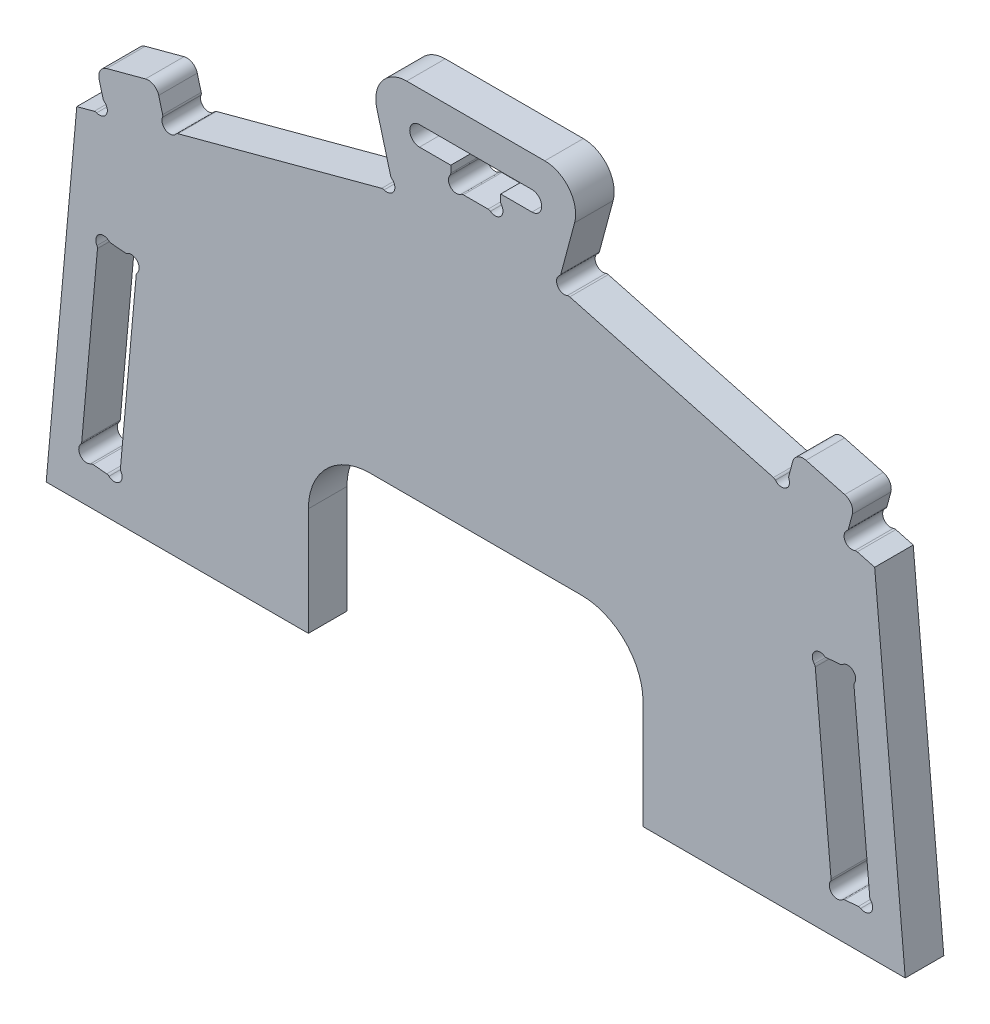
from build123d import *

# Parameters (mm, degrees)
BOSS_EXTRUDE1_DEPTH = 25
CUT_EXTRUDE1_DEPTH  = 442.759267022
FILLET1_R           = 7


with BuildPart() as part:
    # Sketch1 → Boss-Extrude1 (new body)
    with BuildSketch(Plane.XY):
        with BuildLine():
            Line((0, 0), (19.831354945, 220.72298054))
            Line((19.831354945, 220.72298054), (31.118590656, 223.747386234))
            ThreePointArc((31.118590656, 223.747386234), (31.908216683, 223.828502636), (32.683468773, 223.6579936))
            ThreePointArc((32.683468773, 223.6579936), (38.972572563, 225.851854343), (37.727959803, 232.395308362))
            ThreePointArc((37.727959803, 232.395308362), (37.192668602, 232.981441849), (36.868104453, 233.705836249))
            Line((36.868104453, 233.705836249), (32.502096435, 250))
            Line((32.502096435, 250), (71.139129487, 260.352761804))
            Line((71.139129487, 260.352761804), (75.505137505, 244.058598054))
            ThreePointArc((75.505137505, 244.058598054), (75.586253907, 243.268972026), (75.415744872, 242.493719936))
            ThreePointArc((75.415744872, 242.493719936), (77.609605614, 236.204616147), (84.153059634, 237.449228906))
            ThreePointArc((84.153059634, 237.449228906), (84.73919312, 237.984520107), (85.463587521, 238.309084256))
            Line((85.463587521, 238.309084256), (217.54227513, 273.699461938))
            ThreePointArc((217.54227513, 273.699461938), (218.331901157, 273.78057834), (219.107153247, 273.610069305))
            ThreePointArc((219.107153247, 273.610069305), (225.396257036, 275.803930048), (224.151644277, 282.347384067))
            ThreePointArc((224.151644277, 282.347384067), (223.616353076, 282.933517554), (223.291788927, 283.657911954))
            Line((223.291788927, 283.657911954), (214.405064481, 316.823619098))
            ThreePointArc((214.405064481, 316.823619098), (217.856514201, 334.17522858), (233.723581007, 342))
            Line((233.723581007, 342), (278.5, 342))
            Line((278.5, 342), (278.5, 321.725447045))
            Line((278.5, 321.725447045), (242.040047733, 321.725447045))
            ThreePointArc((242.040047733, 321.725447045), (235.715047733, 315.400447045), (242.040047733, 309.075447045))
            Line((242.040047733, 309.075447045), (262.324710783, 309.075447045))
            Line((262.324710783, 309.075447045), (262.324710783, 304.656487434))
            ThreePointArc((262.324710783, 304.656487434), (262.198692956, 303.872772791), (261.833343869, 303.168067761))
            ThreePointArc((261.833343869, 303.168067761), (262.324710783, 296.525447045), (268.967331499, 296.034080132))
            ThreePointArc((268.967331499, 296.034080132), (269.672036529, 296.399429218), (270.455751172, 296.525447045))
            Line((270.455751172, 296.525447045), (278.5, 296.525447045))
            Line((278.5, 296.525447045), (278.5, 110))
            Line((278.5, 110), (210, 110))
            ThreePointArc((210, 110), (181.715728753, 98.284271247), (170, 70))
            Line((170, 70), (170, 0))
            Line((170, 0), (0, 0))
        make_face()
    extrude(amount=BOSS_EXTRUDE1_DEPTH)

    # Sketch2 → Cut-Extrude1 (cut, through all)
    with BuildSketch(Plane.XY):
        with BuildLine():
            Line((58.352234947, 145.475391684), (48.120501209, 31.596195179))
            ThreePointArc((48.120501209, 31.596195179), (48.175881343, 30.804347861), (48.476702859, 30.069776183))
            ThreePointArc((48.476702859, 30.069776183), (47.392880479, 23.497776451), (40.732939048, 23.602807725))
            ThreePointArc((40.732939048, 23.602807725), (40.063755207, 24.029752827), (39.294461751, 24.225397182))
            Line((39.294461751, 24.225397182), (30.392401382, 25.025222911))
            ThreePointArc((30.392401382, 25.025222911), (29.600554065, 24.969842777), (28.865982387, 24.669021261))
            ThreePointArc((28.865982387, 24.669021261), (22.293982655, 25.752843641), (22.399013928, 32.412785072))
            ThreePointArc((22.399013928, 32.412785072), (22.825959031, 33.081968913), (23.021603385, 33.851262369))
            Line((23.021603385, 33.851262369), (33.253337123, 147.730458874))
            ThreePointArc((33.253337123, 147.730458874), (33.197956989, 148.522306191), (32.897135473, 149.256877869))
            ThreePointArc((32.897135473, 149.256877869), (33.980957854, 155.828877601), (40.640899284, 155.723846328))
            ThreePointArc((40.640899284, 155.723846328), (41.310083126, 155.296901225), (42.079376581, 155.101256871))
            Line((42.079376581, 155.101256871), (50.98143695, 154.301431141))
            ThreePointArc((50.98143695, 154.301431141), (51.773284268, 154.356811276), (52.507855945, 154.657632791))
            ThreePointArc((52.507855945, 154.657632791), (59.079855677, 153.573810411), (58.974824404, 146.913868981))
            ThreePointArc((58.974824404, 146.913868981), (58.547879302, 146.244685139), (58.352234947, 145.475391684))
        make_face()
    extrude(amount=CUT_EXTRUDE1_DEPTH, mode=Mode.SUBTRACT)

    # Fillet1
    fillet1_edges = [part.edges().sort_by_distance(p)[0] for p in [
        (71.139129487, 260.352761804, 12.5),
        (32.502096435, 250, 12.5),
    ]]
    fillet(fillet1_edges, radius=FILLET1_R)

    # Sym_trie1: part across plane


with BuildPart() as part_1:
    add(part.part)
    add(part.part.mirror(Plane(origin=(278.5, 296.525447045, 25), x_dir=(0, 0, 1), z_dir=(1, 0, 0))))


solid = part_1.part
